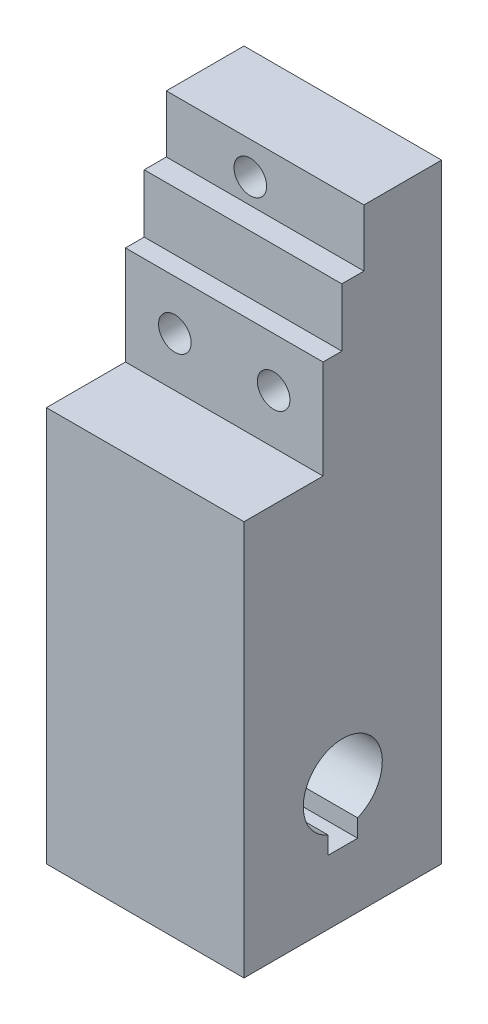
ISO-10303-21;
HEADER;
FILE_DESCRIPTION(('STEP AP214'),'2;1');
FILE_NAME('part.step','',(''),(''),'','','');
FILE_SCHEMA(('AUTOMOTIVE_DESIGN { 1 0 10303 214 1 1 1 1 }'));
ENDSEC;
DATA;
#1=APPLICATION_CONTEXT('core data for automotive mechanical design processes');
#2=APPLICATION_PROTOCOL_DEFINITION('international standard','automotive_design',2000,#1);
#3=PRODUCT_CONTEXT('',#1,'mechanical');
#4=PRODUCT('Part','Part','',(#3));
#5=PRODUCT_RELATED_PRODUCT_CATEGORY('part','',(#4));
#6=PRODUCT_DEFINITION_FORMATION('','',#4);
#7=PRODUCT_DEFINITION_CONTEXT('part definition',#1,'design');
#8=PRODUCT_DEFINITION('design','',#6,#7);
#9=PRODUCT_DEFINITION_SHAPE('','',#8);
#10=(LENGTH_UNIT() NAMED_UNIT(*) SI_UNIT(.MILLI.,.METRE.));
#11=(NAMED_UNIT(*) PLANE_ANGLE_UNIT() SI_UNIT($,.RADIAN.));
#12=(NAMED_UNIT(*) SI_UNIT($,.STERADIAN.) SOLID_ANGLE_UNIT());
#13=UNCERTAINTY_MEASURE_WITH_UNIT(LENGTH_MEASURE(1.E-05),#10,'distance_accuracy_value','');
#14=(GEOMETRIC_REPRESENTATION_CONTEXT(3) GLOBAL_UNCERTAINTY_ASSIGNED_CONTEXT((#13)) GLOBAL_UNIT_ASSIGNED_CONTEXT((#10,
#11,#12)) REPRESENTATION_CONTEXT('',''));
#15=CARTESIAN_POINT('',(0.,0.,0.));
#16=DIRECTION('',(0.,0.,1.));
#17=DIRECTION('',(1.,0.,0.));
#18=AXIS2_PLACEMENT_3D('',#15,#16,#17);
#19=CARTESIAN_POINT('',(0.,0.,20.));
#20=DIRECTION('',(1.,0.,0.));
#21=DIRECTION('',(0.,0.,-1.));
#22=AXIS2_PLACEMENT_3D('',#19,#20,#21);
#23=PLANE('',#22);
#24=DIRECTION('',(0.,-1.,0.));
#25=VECTOR('',#24,1.);
#26=CARTESIAN_POINT('',(0.,6.50000000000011,11.4999999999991));
#27=LINE('',#26,#25);
#28=CARTESIAN_POINT('',(0.,8.29190075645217,11.4999999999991));
#29=VERTEX_POINT('',#28);
#30=CARTESIAN_POINT('',(0.,6.50000000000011,11.4999999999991));
#31=VERTEX_POINT('',#30);
#32=EDGE_CURVE('E143',#29,#31,#27,.T.);
#33=ORIENTED_EDGE('',*,*,#32,.T.);
#34=DIRECTION('',(0.,0.,-1.));
#35=VECTOR('',#34,1.);
#36=CARTESIAN_POINT('',(0.,6.50000000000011,11.4999999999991));
#37=LINE('',#36,#35);
#38=CARTESIAN_POINT('',(0.,6.50000000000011,8.49999999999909));
#39=VERTEX_POINT('',#38);
#40=EDGE_CURVE('E137',#31,#39,#37,.T.);
#41=ORIENTED_EDGE('',*,*,#40,.T.);
#42=DIRECTION('',(0.,1.,0.));
#43=VECTOR('',#42,1.);
#44=CARTESIAN_POINT('',(0.,6.50000000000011,8.49999999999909));
#45=LINE('',#44,#43);
#46=CARTESIAN_POINT('',(0.,8.29190075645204,8.49999999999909));
#47=VERTEX_POINT('',#46);
#48=EDGE_CURVE('E146',#39,#47,#45,.T.);
#49=ORIENTED_EDGE('',*,*,#48,.T.);
#50=CARTESIAN_POINT('',(0.,12.0000000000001,9.99999999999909));
#51=DIRECTION('',(1.,0.,0.));
#52=DIRECTION('',(0.,0.,-1.));
#53=AXIS2_PLACEMENT_3D('',#50,#51,#52);
#54=CIRCLE('',#53,4.00000000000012);
#55=EDGE_CURVE('E49',#47,#29,#54,.T.);
#56=ORIENTED_EDGE('',*,*,#55,.T.);
#57=EDGE_LOOP('',(#33,#41,#49,#56));
#58=FACE_BOUND('',#57,.T.);
#59=DIRECTION('',(0.,-1.,0.));
#60=VECTOR('',#59,1.);
#61=CARTESIAN_POINT('',(0.,55.9000000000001,7.85999999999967));
#62=LINE('',#61,#60);
#63=CARTESIAN_POINT('',(0.,61.7,7.85999999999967));
#64=VERTEX_POINT('',#63);
#65=CARTESIAN_POINT('',(0.,55.9000000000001,7.85999999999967));
#66=VERTEX_POINT('',#65);
#67=EDGE_CURVE('E184',#64,#66,#62,.T.);
#68=ORIENTED_EDGE('',*,*,#67,.F.);
#69=DIRECTION('',(0.,0.,-1.));
#70=VECTOR('',#69,1.);
#71=CARTESIAN_POINT('',(0.,61.6999999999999,20.));
#72=LINE('',#71,#70);
#73=CARTESIAN_POINT('',(0.,61.6999999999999,0.));
#74=VERTEX_POINT('',#73);
#75=EDGE_CURVE('E233',#64,#74,#72,.T.);
#76=ORIENTED_EDGE('',*,*,#75,.T.);
#77=DIRECTION('',(0.,-1.,0.));
#78=VECTOR('',#77,1.);
#79=CARTESIAN_POINT('',(0.,0.,0.));
#80=LINE('',#79,#78);
#81=CARTESIAN_POINT('',(0.,0.,0.));
#82=VERTEX_POINT('',#81);
#83=EDGE_CURVE('E212',#74,#82,#80,.T.);
#84=ORIENTED_EDGE('',*,*,#83,.T.);
#85=DIRECTION('',(0.,0.,-1.));
#86=VECTOR('',#85,1.);
#87=CARTESIAN_POINT('',(0.,0.,20.));
#88=LINE('',#87,#86);
#89=CARTESIAN_POINT('',(0.,0.,20.));
#90=VERTEX_POINT('',#89);
#91=EDGE_CURVE('E12',#90,#82,#88,.T.);
#92=ORIENTED_EDGE('',*,*,#91,.F.);
#93=DIRECTION('',(0.,-1.,0.));
#94=VECTOR('',#93,1.);
#95=CARTESIAN_POINT('',(0.,0.,20.));
#96=LINE('',#95,#94);
#97=CARTESIAN_POINT('',(0.,40.,20.));
#98=VERTEX_POINT('',#97);
#99=EDGE_CURVE('E225',#98,#90,#96,.T.);
#100=ORIENTED_EDGE('',*,*,#99,.F.);
#101=DIRECTION('',(0.,0.,1.));
#102=VECTOR('',#101,1.);
#103=CARTESIAN_POINT('',(0.,40.,20.));
#104=LINE('',#103,#102);
#105=CARTESIAN_POINT('',(0.,40.,12.));
#106=VERTEX_POINT('',#105);
#107=EDGE_CURVE('E182',#106,#98,#104,.T.);
#108=ORIENTED_EDGE('',*,*,#107,.F.);
#109=DIRECTION('',(0.,-1.,0.));
#110=VECTOR('',#109,1.);
#111=CARTESIAN_POINT('',(0.,40.,12.));
#112=LINE('',#111,#110);
#113=CARTESIAN_POINT('',(0.,50.,12.));
#114=VERTEX_POINT('',#113);
#115=EDGE_CURVE('E178',#114,#106,#112,.T.);
#116=ORIENTED_EDGE('',*,*,#115,.F.);
#117=DIRECTION('',(0.,0.,1.));
#118=VECTOR('',#117,1.);
#119=CARTESIAN_POINT('',(0.,50.,12.));
#120=LINE('',#119,#118);
#121=CARTESIAN_POINT('',(0.,50.,10.0999999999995));
#122=VERTEX_POINT('',#121);
#123=EDGE_CURVE('E175',#122,#114,#120,.T.);
#124=ORIENTED_EDGE('',*,*,#123,.F.);
#125=DIRECTION('',(0.,-1.,0.));
#126=VECTOR('',#125,1.);
#127=CARTESIAN_POINT('',(0.,50.,10.0999999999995));
#128=LINE('',#127,#126);
#129=CARTESIAN_POINT('',(0.,55.9000000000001,10.0999999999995));
#130=VERTEX_POINT('',#129);
#131=EDGE_CURVE('E190',#130,#122,#128,.T.);
#132=ORIENTED_EDGE('',*,*,#131,.F.);
#133=DIRECTION('',(0.,0.,1.));
#134=VECTOR('',#133,1.);
#135=CARTESIAN_POINT('',(0.,55.9000000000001,10.0999999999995));
#136=LINE('',#135,#134);
#137=EDGE_CURVE('E187',#66,#130,#136,.T.);
#138=ORIENTED_EDGE('',*,*,#137,.F.);
#139=EDGE_LOOP('',(#68,#76,#84,#92,#100,#108,#116,#124,#132,#138));
#140=FACE_BOUND('',#139,.T.);
#141=ADVANCED_FACE('F33',(#58,#140),#23,.F.);
#142=CARTESIAN_POINT('',(20.,0.,20.));
#143=DIRECTION('',(-1.,0.,0.));
#144=DIRECTION('',(0.,0.,1.));
#145=AXIS2_PLACEMENT_3D('',#142,#143,#144);
#146=PLANE('',#145);
#147=DIRECTION('',(0.,1.,0.));
#148=VECTOR('',#147,1.);
#149=CARTESIAN_POINT('',(20.,6.50000000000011,8.49999999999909));
#150=LINE('',#149,#148);
#151=CARTESIAN_POINT('',(20.,6.50000000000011,8.49999999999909));
#152=VERTEX_POINT('',#151);
#153=CARTESIAN_POINT('',(20.,8.29190075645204,8.49999999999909));
#154=VERTEX_POINT('',#153);
#155=EDGE_CURVE('E164',#152,#154,#150,.T.);
#156=ORIENTED_EDGE('',*,*,#155,.F.);
#157=DIRECTION('',(0.,0.,-1.));
#158=VECTOR('',#157,1.);
#159=CARTESIAN_POINT('',(20.,6.50000000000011,11.4999999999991));
#160=LINE('',#159,#158);
#161=CARTESIAN_POINT('',(20.,6.50000000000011,11.4999999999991));
#162=VERTEX_POINT('',#161);
#163=EDGE_CURVE('E57',#162,#152,#160,.T.);
#164=ORIENTED_EDGE('',*,*,#163,.F.);
#165=DIRECTION('',(0.,-1.,0.));
#166=VECTOR('',#165,1.);
#167=CARTESIAN_POINT('',(20.,6.50000000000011,11.4999999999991));
#168=LINE('',#167,#166);
#169=CARTESIAN_POINT('',(20.,8.29190075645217,11.4999999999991));
#170=VERTEX_POINT('',#169);
#171=EDGE_CURVE('E152',#170,#162,#168,.T.);
#172=ORIENTED_EDGE('',*,*,#171,.F.);
#173=CARTESIAN_POINT('',(20.,12.0000000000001,9.99999999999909));
#174=DIRECTION('',(1.,0.,0.));
#175=DIRECTION('',(0.,0.,-1.));
#176=AXIS2_PLACEMENT_3D('',#173,#174,#175);
#177=CIRCLE('',#176,4.00000000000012);
#178=EDGE_CURVE('E155',#154,#170,#177,.T.);
#179=ORIENTED_EDGE('',*,*,#178,.F.);
#180=EDGE_LOOP('',(#156,#164,#172,#179));
#181=FACE_BOUND('',#180,.T.);
#182=DIRECTION('',(0.,-1.,0.));
#183=VECTOR('',#182,1.);
#184=CARTESIAN_POINT('',(20.,55.9000000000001,7.85999999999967));
#185=LINE('',#184,#183);
#186=CARTESIAN_POINT('',(20.,61.7,7.85999999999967));
#187=VERTEX_POINT('',#186);
#188=CARTESIAN_POINT('',(20.,55.9000000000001,7.85999999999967));
#189=VERTEX_POINT('',#188);
#190=EDGE_CURVE('E202',#187,#189,#185,.T.);
#191=ORIENTED_EDGE('',*,*,#190,.T.);
#192=DIRECTION('',(0.,0.,1.));
#193=VECTOR('',#192,1.);
#194=CARTESIAN_POINT('',(20.,55.9000000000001,10.0999999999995));
#195=LINE('',#194,#193);
#196=CARTESIAN_POINT('',(20.,55.9000000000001,10.0999999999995));
#197=VERTEX_POINT('',#196);
#198=EDGE_CURVE('E205',#189,#197,#195,.T.);
#199=ORIENTED_EDGE('',*,*,#198,.T.);
#200=DIRECTION('',(0.,-1.,0.));
#201=VECTOR('',#200,1.);
#202=CARTESIAN_POINT('',(20.,50.,10.0999999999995));
#203=LINE('',#202,#201);
#204=CARTESIAN_POINT('',(20.,50.,10.0999999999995));
#205=VERTEX_POINT('',#204);
#206=EDGE_CURVE('E179',#197,#205,#203,.T.);
#207=ORIENTED_EDGE('',*,*,#206,.T.);
#208=DIRECTION('',(0.,0.,1.));
#209=VECTOR('',#208,1.);
#210=CARTESIAN_POINT('',(20.,50.,12.));
#211=LINE('',#210,#209);
#212=CARTESIAN_POINT('',(20.,50.,12.));
#213=VERTEX_POINT('',#212);
#214=EDGE_CURVE('E171',#205,#213,#211,.T.);
#215=ORIENTED_EDGE('',*,*,#214,.T.);
#216=DIRECTION('',(0.,-1.,0.));
#217=VECTOR('',#216,1.);
#218=CARTESIAN_POINT('',(20.,40.,12.));
#219=LINE('',#218,#217);
#220=CARTESIAN_POINT('',(20.,40.,12.));
#221=VERTEX_POINT('',#220);
#222=EDGE_CURVE('E196',#213,#221,#219,.T.);
#223=ORIENTED_EDGE('',*,*,#222,.T.);
#224=DIRECTION('',(0.,0.,1.));
#225=VECTOR('',#224,1.);
#226=CARTESIAN_POINT('',(20.,40.,20.));
#227=LINE('',#226,#225);
#228=CARTESIAN_POINT('',(20.,40.,20.));
#229=VERTEX_POINT('',#228);
#230=EDGE_CURVE('E199',#221,#229,#227,.T.);
#231=ORIENTED_EDGE('',*,*,#230,.T.);
#232=DIRECTION('',(0.,1.,0.));
#233=VECTOR('',#232,1.);
#234=CARTESIAN_POINT('',(20.,0.,20.));
#235=LINE('',#234,#233);
#236=CARTESIAN_POINT('',(20.,0.,20.));
#237=VERTEX_POINT('',#236);
#238=EDGE_CURVE('E230',#237,#229,#235,.T.);
#239=ORIENTED_EDGE('',*,*,#238,.F.);
#240=DIRECTION('',(0.,0.,-1.));
#241=VECTOR('',#240,1.);
#242=CARTESIAN_POINT('',(20.,0.,20.));
#243=LINE('',#242,#241);
#244=CARTESIAN_POINT('',(20.,0.,0.));
#245=VERTEX_POINT('',#244);
#246=EDGE_CURVE('E41',#237,#245,#243,.T.);
#247=ORIENTED_EDGE('',*,*,#246,.T.);
#248=DIRECTION('',(0.,1.,0.));
#249=VECTOR('',#248,1.);
#250=CARTESIAN_POINT('',(20.,0.,0.));
#251=LINE('',#250,#249);
#252=CARTESIAN_POINT('',(20.,61.6999999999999,0.));
#253=VERTEX_POINT('',#252);
#254=EDGE_CURVE('E238',#245,#253,#251,.T.);
#255=ORIENTED_EDGE('',*,*,#254,.T.);
#256=DIRECTION('',(0.,0.,-1.));
#257=VECTOR('',#256,1.);
#258=CARTESIAN_POINT('',(20.,61.6999999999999,20.));
#259=LINE('',#258,#257);
#260=EDGE_CURVE('E244',#187,#253,#259,.T.);
#261=ORIENTED_EDGE('',*,*,#260,.F.);
#262=EDGE_LOOP('',(#191,#199,#207,#215,#223,#231,#239,#247,#255,#261));
#263=FACE_BOUND('',#262,.T.);
#264=ADVANCED_FACE('F274',(#181,#263),#146,.F.);
#265=CARTESIAN_POINT('',(0.,61.6999999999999,20.));
#266=DIRECTION('',(0.,-1.,0.));
#267=DIRECTION('',(0.,0.,-1.));
#268=AXIS2_PLACEMENT_3D('',#265,#266,#267);
#269=PLANE('',#268);
#270=DIRECTION('',(1.,0.,0.));
#271=VECTOR('',#270,1.);
#272=CARTESIAN_POINT('',(0.,61.7,7.85999999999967));
#273=LINE('',#272,#271);
#274=EDGE_CURVE('E217',#64,#187,#273,.T.);
#275=ORIENTED_EDGE('',*,*,#274,.T.);
#276=ORIENTED_EDGE('',*,*,#260,.T.);
#277=DIRECTION('',(-1.,0.,0.));
#278=VECTOR('',#277,1.);
#279=CARTESIAN_POINT('',(0.,61.6999999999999,0.));
#280=LINE('',#279,#278);
#281=EDGE_CURVE('E228',#253,#74,#280,.T.);
#282=ORIENTED_EDGE('',*,*,#281,.T.);
#283=ORIENTED_EDGE('',*,*,#75,.F.);
#284=EDGE_LOOP('',(#275,#276,#282,#283));
#285=FACE_BOUND('',#284,.T.);
#286=ADVANCED_FACE('F278',(#285),#269,.F.);
#287=CARTESIAN_POINT('',(0.,61.6999999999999,20.));
#288=DIRECTION('',(0.,0.,-1.));
#289=DIRECTION('',(-1.,0.,0.));
#290=AXIS2_PLACEMENT_3D('',#287,#288,#289);
#291=PLANE('',#290);
#292=DIRECTION('',(1.,0.,0.));
#293=VECTOR('',#292,1.);
#294=CARTESIAN_POINT('',(0.,40.,20.));
#295=LINE('',#294,#293);
#296=EDGE_CURVE('E220',#98,#229,#295,.T.);
#297=ORIENTED_EDGE('',*,*,#296,.F.);
#298=ORIENTED_EDGE('',*,*,#99,.T.);
#299=DIRECTION('',(1.,0.,0.));
#300=VECTOR('',#299,1.);
#301=CARTESIAN_POINT('',(0.,0.,20.));
#302=LINE('',#301,#300);
#303=EDGE_CURVE('E227',#90,#237,#302,.T.);
#304=ORIENTED_EDGE('',*,*,#303,.T.);
#305=ORIENTED_EDGE('',*,*,#238,.T.);
#306=EDGE_LOOP('',(#297,#298,#304,#305));
#307=FACE_BOUND('',#306,.T.);
#308=ADVANCED_FACE('F284',(#307),#291,.F.);
#309=CARTESIAN_POINT('',(0.,0.,20.));
#310=DIRECTION('',(0.,1.,0.));
#311=DIRECTION('',(0.,0.,1.));
#312=AXIS2_PLACEMENT_3D('',#309,#310,#311);
#313=PLANE('',#312);
#314=DIRECTION('',(1.,0.,0.));
#315=VECTOR('',#314,1.);
#316=CARTESIAN_POINT('',(0.,0.,0.));
#317=LINE('',#316,#315);
#318=EDGE_CURVE('E236',#82,#245,#317,.T.);
#319=ORIENTED_EDGE('',*,*,#318,.T.);
#320=ORIENTED_EDGE('',*,*,#246,.F.);
#321=ORIENTED_EDGE('',*,*,#303,.F.);
#322=ORIENTED_EDGE('',*,*,#91,.T.);
#323=EDGE_LOOP('',(#319,#320,#321,#322));
#324=FACE_BOUND('',#323,.T.);
#325=ADVANCED_FACE('F289',(#324),#313,.F.);
#326=CARTESIAN_POINT('',(0.,61.6999999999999,0.));
#327=DIRECTION('',(0.,0.,-1.));
#328=DIRECTION('',(-1.,0.,0.));
#329=AXIS2_PLACEMENT_3D('',#326,#327,#328);
#330=PLANE('',#329);
#331=CARTESIAN_POINT('',(8.5,58.3999999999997,0.));
#332=DIRECTION('',(0.,0.,1.));
#333=DIRECTION('',(1.,0.,0.));
#334=AXIS2_PLACEMENT_3D('',#331,#332,#333);
#335=CIRCLE('',#334,1.65);
#336=CARTESIAN_POINT('',(10.15,58.3999999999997,0.));
#337=VERTEX_POINT('',#336);
#338=EDGE_CURVE('E475',#337,#337,#335,.T.);
#339=ORIENTED_EDGE('',*,*,#338,.T.);
#340=EDGE_LOOP('',(#339));
#341=FACE_BOUND('',#340,.T.);
#342=CARTESIAN_POINT('',(15.,44.9999999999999,0.));
#343=DIRECTION('',(0.,0.,1.));
#344=DIRECTION('',(1.,0.,0.));
#345=AXIS2_PLACEMENT_3D('',#342,#343,#344);
#346=CIRCLE('',#345,1.65);
#347=CARTESIAN_POINT('',(16.65,44.9999999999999,0.));
#348=VERTEX_POINT('',#347);
#349=EDGE_CURVE('E479',#348,#348,#346,.T.);
#350=ORIENTED_EDGE('',*,*,#349,.T.);
#351=EDGE_LOOP('',(#350));
#352=FACE_BOUND('',#351,.T.);
#353=CARTESIAN_POINT('',(5.,44.9999999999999,0.));
#354=DIRECTION('',(0.,0.,1.));
#355=DIRECTION('',(1.,0.,0.));
#356=AXIS2_PLACEMENT_3D('',#353,#354,#355);
#357=CIRCLE('',#356,1.65);
#358=CARTESIAN_POINT('',(6.65,44.9999999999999,0.));
#359=VERTEX_POINT('',#358);
#360=EDGE_CURVE('E485',#359,#359,#357,.T.);
#361=ORIENTED_EDGE('',*,*,#360,.T.);
#362=EDGE_LOOP('',(#361));
#363=FACE_BOUND('',#362,.T.);
#364=CARTESIAN_POINT('',(10.,12.,0.));
#365=DIRECTION('',(0.,0.,-1.));
#366=DIRECTION('',(-1.,0.,0.));
#367=AXIS2_PLACEMENT_3D('',#364,#365,#366);
#368=CIRCLE('',#367,1.64999999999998);
#369=CARTESIAN_POINT('',(8.35000000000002,12.,0.));
#370=VERTEX_POINT('',#369);
#371=EDGE_CURVE('E158',#370,#370,#368,.T.);
#372=ORIENTED_EDGE('',*,*,#371,.F.);
#373=EDGE_LOOP('',(#372));
#374=FACE_BOUND('',#373,.T.);
#375=ORIENTED_EDGE('',*,*,#83,.F.);
#376=ORIENTED_EDGE('',*,*,#281,.F.);
#377=ORIENTED_EDGE('',*,*,#254,.F.);
#378=ORIENTED_EDGE('',*,*,#318,.F.);
#379=EDGE_LOOP('',(#375,#376,#377,#378));
#380=FACE_BOUND('',#379,.T.);
#381=ADVANCED_FACE('F291',(#341,#352,#363,#374,#380),#330,.T.);
#382=CARTESIAN_POINT('',(0.,50.,12.));
#383=DIRECTION('',(0.,1.,0.));
#384=DIRECTION('',(0.,0.,1.));
#385=AXIS2_PLACEMENT_3D('',#382,#383,#384);
#386=PLANE('',#385);
#387=ORIENTED_EDGE('',*,*,#214,.F.);
#388=DIRECTION('',(1.,0.,0.));
#389=VECTOR('',#388,1.);
#390=CARTESIAN_POINT('',(0.,50.,10.0999999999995));
#391=LINE('',#390,#389);
#392=EDGE_CURVE('E210',#122,#205,#391,.T.);
#393=ORIENTED_EDGE('',*,*,#392,.F.);
#394=ORIENTED_EDGE('',*,*,#123,.T.);
#395=DIRECTION('',(1.,0.,0.));
#396=VECTOR('',#395,1.);
#397=CARTESIAN_POINT('',(0.,50.,12.));
#398=LINE('',#397,#396);
#399=EDGE_CURVE('E193',#114,#213,#398,.T.);
#400=ORIENTED_EDGE('',*,*,#399,.T.);
#401=EDGE_LOOP('',(#387,#393,#394,#400));
#402=FACE_BOUND('',#401,.T.);
#403=ADVANCED_FACE('F297',(#402),#386,.T.);
#404=CARTESIAN_POINT('',(0.,50.,10.0999999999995));
#405=DIRECTION('',(0.,0.,1.));
#406=DIRECTION('',(1.,0.,0.));
#407=AXIS2_PLACEMENT_3D('',#404,#405,#406);
#408=PLANE('',#407);
#409=ORIENTED_EDGE('',*,*,#206,.F.);
#410=DIRECTION('',(1.,0.,0.));
#411=VECTOR('',#410,1.);
#412=CARTESIAN_POINT('',(0.,55.9000000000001,10.0999999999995));
#413=LINE('',#412,#411);
#414=EDGE_CURVE('E213',#130,#197,#413,.T.);
#415=ORIENTED_EDGE('',*,*,#414,.F.);
#416=ORIENTED_EDGE('',*,*,#131,.T.);
#417=ORIENTED_EDGE('',*,*,#392,.T.);
#418=EDGE_LOOP('',(#409,#415,#416,#417));
#419=FACE_BOUND('',#418,.T.);
#420=ADVANCED_FACE('F321',(#419),#408,.T.);
#421=CARTESIAN_POINT('',(0.,55.9000000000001,10.0999999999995));
#422=DIRECTION('',(0.,1.,0.));
#423=DIRECTION('',(0.,0.,1.));
#424=AXIS2_PLACEMENT_3D('',#421,#422,#423);
#425=PLANE('',#424);
#426=ORIENTED_EDGE('',*,*,#198,.F.);
#427=DIRECTION('',(1.,0.,0.));
#428=VECTOR('',#427,1.);
#429=CARTESIAN_POINT('',(0.,55.9000000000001,7.85999999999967));
#430=LINE('',#429,#428);
#431=EDGE_CURVE('E215',#66,#189,#430,.T.);
#432=ORIENTED_EDGE('',*,*,#431,.F.);
#433=ORIENTED_EDGE('',*,*,#137,.T.);
#434=ORIENTED_EDGE('',*,*,#414,.T.);
#435=EDGE_LOOP('',(#426,#432,#433,#434));
#436=FACE_BOUND('',#435,.T.);
#437=ADVANCED_FACE('F317',(#436),#425,.T.);
#438=CARTESIAN_POINT('',(0.,55.9000000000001,7.85999999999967));
#439=DIRECTION('',(0.,0.,1.));
#440=DIRECTION('',(1.,0.,0.));
#441=AXIS2_PLACEMENT_3D('',#438,#439,#440);
#442=PLANE('',#441);
#443=CARTESIAN_POINT('',(8.5,58.3999999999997,7.85999999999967));
#444=DIRECTION('',(0.,0.,1.));
#445=DIRECTION('',(1.,0.,0.));
#446=AXIS2_PLACEMENT_3D('',#443,#444,#445);
#447=CIRCLE('',#446,1.65);
#448=CARTESIAN_POINT('',(10.15,58.3999999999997,7.85999999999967));
#449=VERTEX_POINT('',#448);
#450=EDGE_CURVE('E36',#449,#449,#447,.T.);
#451=ORIENTED_EDGE('',*,*,#450,.F.);
#452=EDGE_LOOP('',(#451));
#453=FACE_BOUND('',#452,.T.);
#454=ORIENTED_EDGE('',*,*,#190,.F.);
#455=ORIENTED_EDGE('',*,*,#274,.F.);
#456=ORIENTED_EDGE('',*,*,#67,.T.);
#457=ORIENTED_EDGE('',*,*,#431,.T.);
#458=EDGE_LOOP('',(#454,#455,#456,#457));
#459=FACE_BOUND('',#458,.T.);
#460=ADVANCED_FACE('F313',(#453,#459),#442,.T.);
#461=CARTESIAN_POINT('',(0.,40.,20.));
#462=DIRECTION('',(0.,1.,0.));
#463=DIRECTION('',(0.,0.,1.));
#464=AXIS2_PLACEMENT_3D('',#461,#462,#463);
#465=PLANE('',#464);
#466=ORIENTED_EDGE('',*,*,#230,.F.);
#467=DIRECTION('',(1.,0.,0.));
#468=VECTOR('',#467,1.);
#469=CARTESIAN_POINT('',(0.,40.,12.));
#470=LINE('',#469,#468);
#471=EDGE_CURVE('E222',#106,#221,#470,.T.);
#472=ORIENTED_EDGE('',*,*,#471,.F.);
#473=ORIENTED_EDGE('',*,*,#107,.T.);
#474=ORIENTED_EDGE('',*,*,#296,.T.);
#475=EDGE_LOOP('',(#466,#472,#473,#474));
#476=FACE_BOUND('',#475,.T.);
#477=ADVANCED_FACE('F331',(#476),#465,.T.);
#478=CARTESIAN_POINT('',(0.,40.,12.));
#479=DIRECTION('',(0.,0.,1.));
#480=DIRECTION('',(1.,0.,0.));
#481=AXIS2_PLACEMENT_3D('',#478,#479,#480);
#482=PLANE('',#481);
#483=CARTESIAN_POINT('',(15.,44.9999999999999,12.));
#484=DIRECTION('',(0.,0.,1.));
#485=DIRECTION('',(1.,0.,0.));
#486=AXIS2_PLACEMENT_3D('',#483,#484,#485);
#487=CIRCLE('',#486,1.65);
#488=CARTESIAN_POINT('',(16.65,44.9999999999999,12.));
#489=VERTEX_POINT('',#488);
#490=EDGE_CURVE('E477',#489,#489,#487,.T.);
#491=ORIENTED_EDGE('',*,*,#490,.F.);
#492=EDGE_LOOP('',(#491));
#493=FACE_BOUND('',#492,.T.);
#494=CARTESIAN_POINT('',(5.,44.9999999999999,12.));
#495=DIRECTION('',(0.,0.,1.));
#496=DIRECTION('',(1.,0.,0.));
#497=AXIS2_PLACEMENT_3D('',#494,#495,#496);
#498=CIRCLE('',#497,1.65);
#499=CARTESIAN_POINT('',(6.65,44.9999999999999,12.));
#500=VERTEX_POINT('',#499);
#501=EDGE_CURVE('E482',#500,#500,#498,.T.);
#502=ORIENTED_EDGE('',*,*,#501,.F.);
#503=EDGE_LOOP('',(#502));
#504=FACE_BOUND('',#503,.T.);
#505=ORIENTED_EDGE('',*,*,#222,.F.);
#506=ORIENTED_EDGE('',*,*,#399,.F.);
#507=ORIENTED_EDGE('',*,*,#115,.T.);
#508=ORIENTED_EDGE('',*,*,#471,.T.);
#509=EDGE_LOOP('',(#505,#506,#507,#508));
#510=FACE_BOUND('',#509,.T.);
#511=ADVANCED_FACE('F271',(#493,#504,#510),#482,.T.);
#512=CARTESIAN_POINT('',(0.,6.50000000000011,11.4999999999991));
#513=DIRECTION('',(0.,-1.,0.));
#514=DIRECTION('',(0.,0.,-1.));
#515=AXIS2_PLACEMENT_3D('',#512,#513,#514);
#516=PLANE('',#515);
#517=ORIENTED_EDGE('',*,*,#163,.T.);
#518=DIRECTION('',(1.,0.,0.));
#519=VECTOR('',#518,1.);
#520=CARTESIAN_POINT('',(0.,6.50000000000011,8.49999999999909));
#521=LINE('',#520,#519);
#522=EDGE_CURVE('E133',#39,#152,#521,.T.);
#523=ORIENTED_EDGE('',*,*,#522,.F.);
#524=ORIENTED_EDGE('',*,*,#40,.F.);
#525=DIRECTION('',(1.,0.,0.));
#526=VECTOR('',#525,1.);
#527=CARTESIAN_POINT('',(0.,6.50000000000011,11.4999999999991));
#528=LINE('',#527,#526);
#529=EDGE_CURVE('E169',#31,#162,#528,.T.);
#530=ORIENTED_EDGE('',*,*,#529,.T.);
#531=EDGE_LOOP('',(#517,#523,#524,#530));
#532=FACE_BOUND('',#531,.T.);
#533=ADVANCED_FACE('F135',(#532),#516,.F.);
#534=CARTESIAN_POINT('',(0.,6.50000000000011,11.4999999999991));
#535=DIRECTION('',(0.,0.,1.));
#536=DIRECTION('',(1.,0.,0.));
#537=AXIS2_PLACEMENT_3D('',#534,#535,#536);
#538=PLANE('',#537);
#539=ORIENTED_EDGE('',*,*,#171,.T.);
#540=ORIENTED_EDGE('',*,*,#529,.F.);
#541=ORIENTED_EDGE('',*,*,#32,.F.);
#542=DIRECTION('',(1.,0.,0.));
#543=VECTOR('',#542,1.);
#544=CARTESIAN_POINT('',(0.,8.29190075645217,11.4999999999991));
#545=LINE('',#544,#543);
#546=EDGE_CURVE('E172',#29,#170,#545,.T.);
#547=ORIENTED_EDGE('',*,*,#546,.T.);
#548=EDGE_LOOP('',(#539,#540,#541,#547));
#549=FACE_BOUND('',#548,.T.);
#550=ADVANCED_FACE('F263',(#549),#538,.F.);
#551=CARTESIAN_POINT('',(0.,12.0000000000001,9.99999999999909));
#552=DIRECTION('',(1.,0.,0.));
#553=DIRECTION('',(0.,0.,-1.));
#554=AXIS2_PLACEMENT_3D('',#551,#552,#553);
#555=CYLINDRICAL_SURFACE('',#554,4.00000000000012);
#556=CARTESIAN_POINT('',(8.35000000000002,12.,5.99999999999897));
#557=CARTESIAN_POINT('',(8.35000921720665,12.0884596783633,6.00000690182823));
#558=CARTESIAN_POINT('',(8.35715601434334,12.1770622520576,6.00296854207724));
#559=CARTESIAN_POINT('',(8.38549114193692,12.3517596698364,6.01452886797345));
#560=CARTESIAN_POINT('',(8.40671651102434,12.437847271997,6.02314242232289));
#561=CARTESIAN_POINT('',(8.46229481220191,12.6047024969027,6.04508034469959));
#562=CARTESIAN_POINT('',(8.49660364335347,12.6854869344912,6.05838887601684));
#563=CARTESIAN_POINT('',(8.57719475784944,12.8400766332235,6.08841713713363));
#564=CARTESIAN_POINT('',(8.62347328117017,12.9138840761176,6.10513579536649));
#565=CARTESIAN_POINT('',(8.72910675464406,13.0561876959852,6.14123099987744));
#566=CARTESIAN_POINT('',(8.78895767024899,13.1242937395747,6.16069345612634));
#567=CARTESIAN_POINT('',(8.91898883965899,13.2498357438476,6.19970516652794));
#568=CARTESIAN_POINT('',(8.98917439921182,13.3072661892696,6.2192544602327));
#569=CARTESIAN_POINT('',(9.14196824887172,13.4125482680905,6.25727448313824));
#570=CARTESIAN_POINT('',(9.22501111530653,13.4598078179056,6.27564840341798));
#571=CARTESIAN_POINT('',(9.39873630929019,13.539513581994,6.30787863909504));
#572=CARTESIAN_POINT('',(9.48941475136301,13.5719672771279,6.32173723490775));
#573=CARTESIAN_POINT('',(9.67134799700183,13.6195373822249,6.34243978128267));
#574=CARTESIAN_POINT('',(9.76237107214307,13.6354037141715,6.34958550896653));
#575=CARTESIAN_POINT('',(9.94604650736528,13.651689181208,6.35692285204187));
#576=CARTESIAN_POINT('',(10.0386979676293,13.65211659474,6.35711819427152));
#577=CARTESIAN_POINT('',(10.2155988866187,13.6380778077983,6.35078861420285));
#578=CARTESIAN_POINT('',(10.2999581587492,13.6247239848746,6.3447656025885));
#579=CARTESIAN_POINT('',(10.4651102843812,13.585364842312,6.32752467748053));
#580=CARTESIAN_POINT('',(10.5459024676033,13.5593571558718,6.31630579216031));
#581=CARTESIAN_POINT('',(10.7036451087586,13.4949241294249,6.2896854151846));
#582=CARTESIAN_POINT('',(10.7804787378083,13.4562486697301,6.27420076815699));
#583=CARTESIAN_POINT('',(10.92686023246,13.3677544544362,6.24081383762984));
#584=CARTESIAN_POINT('',(10.9964052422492,13.3179313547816,6.22291061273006));
#585=CARTESIAN_POINT('',(11.1322864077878,13.2037191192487,6.18490257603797));
#586=CARTESIAN_POINT('',(11.1978819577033,13.1384663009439,6.16473811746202));
#587=CARTESIAN_POINT('',(11.3174446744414,12.9976825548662,6.1257308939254));
#588=CARTESIAN_POINT('',(11.3714092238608,12.9221493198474,6.10688842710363));
#589=CARTESIAN_POINT('',(11.467234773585,12.7607363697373,6.07212067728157));
#590=CARTESIAN_POINT('',(11.5088002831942,12.6746640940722,6.05626949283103));
#591=CARTESIAN_POINT('',(11.5766030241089,12.495928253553,6.0298368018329));
#592=CARTESIAN_POINT('',(11.6028485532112,12.4032682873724,6.01925244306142));
#593=CARTESIAN_POINT('',(11.6377295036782,12.2201813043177,6.00507549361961));
#594=CARTESIAN_POINT('',(11.6473591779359,12.1299741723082,6.00108878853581));
#595=CARTESIAN_POINT('',(11.6516920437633,11.9491525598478,5.99930253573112));
#596=CARTESIAN_POINT('',(11.6463994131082,11.8585382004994,6.00150125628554));
#597=CARTESIAN_POINT('',(11.621754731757,11.6840922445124,6.01158252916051));
#598=CARTESIAN_POINT('',(11.6030959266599,11.6001446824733,6.01918468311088));
#599=CARTESIAN_POINT('',(11.5532079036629,11.4366595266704,6.03901112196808));
#600=CARTESIAN_POINT('',(11.5219770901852,11.3571224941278,6.05123599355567));
#601=CARTESIAN_POINT('',(11.4468106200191,11.2019380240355,6.07960271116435));
#602=CARTESIAN_POINT('',(11.4025114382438,11.1264873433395,6.09585414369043));
#603=CARTESIAN_POINT('',(11.3028660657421,10.9838215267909,6.13053231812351));
#604=CARTESIAN_POINT('',(11.2475153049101,10.9166098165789,6.14895995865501));
#605=CARTESIAN_POINT('',(11.122795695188,10.7873800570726,6.1875970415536));
#606=CARTESIAN_POINT('',(11.0527161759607,10.7260563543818,6.20784083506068));
#607=CARTESIAN_POINT('',(10.9029287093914,10.615851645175,6.2466607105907));
#608=CARTESIAN_POINT('',(10.8232187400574,10.5669732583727,6.26523644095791));
#609=CARTESIAN_POINT('',(10.6549046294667,10.4825771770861,6.29871299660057));
#610=CARTESIAN_POINT('',(10.5661980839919,10.4472419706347,6.31356275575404));
#611=CARTESIAN_POINT('',(10.3832908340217,10.3923038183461,6.33718359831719));
#612=CARTESIAN_POINT('',(10.2890946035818,10.3726882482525,6.34595955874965));
#613=CARTESIAN_POINT('',(10.1055697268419,10.3509887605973,6.35570440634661));
#614=CARTESIAN_POINT('',(10.016412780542,10.3476895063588,6.35721426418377));
#615=CARTESIAN_POINT('',(9.8388715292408,10.3554851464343,6.35368821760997));
#616=CARTESIAN_POINT('',(9.75048711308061,10.3665779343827,6.34865327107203));
#617=CARTESIAN_POINT('',(9.58106692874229,10.4018288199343,6.333095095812));
#618=CARTESIAN_POINT('',(9.49987928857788,10.4253804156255,6.32282738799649));
#619=CARTESIAN_POINT('',(9.34258547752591,10.4842940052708,6.29815588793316));
#620=CARTESIAN_POINT('',(9.26648073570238,10.5196593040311,6.28375093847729));
#621=CARTESIAN_POINT('',(9.1165779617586,10.6036193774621,6.25136591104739));
#622=CARTESIAN_POINT('',(9.04318592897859,10.6528755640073,6.23322422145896));
#623=CARTESIAN_POINT('',(8.90532831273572,10.7622828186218,6.1958713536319));
#624=CARTESIAN_POINT('',(8.84086573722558,10.8224375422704,6.17665981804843));
#625=CARTESIAN_POINT('',(8.71800586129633,10.9569926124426,6.13769827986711));
#626=CARTESIAN_POINT('',(8.66036077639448,11.0320998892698,6.11800640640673));
#627=CARTESIAN_POINT('',(8.55845984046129,11.191656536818,6.08167573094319));
#628=CARTESIAN_POINT('',(8.51421011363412,11.2761101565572,6.06503832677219));
#629=CARTESIAN_POINT('',(8.44133626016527,11.4505852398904,6.03694308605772));
#630=CARTESIAN_POINT('',(8.41245757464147,11.5404866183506,6.02540144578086));
#631=CARTESIAN_POINT('',(8.37048891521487,11.7242807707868,6.00845561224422));
#632=CARTESIAN_POINT('',(8.35734933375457,11.818160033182,6.00303213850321));
#633=CARTESIAN_POINT('',(8.35077322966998,11.9415557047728,6.00031805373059));
#634=CARTESIAN_POINT('',(8.34999695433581,11.9707700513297,5.99999771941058));
#635=CARTESIAN_POINT('',(8.35000000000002,12.,5.99999999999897));
#636=B_SPLINE_CURVE_WITH_KNOTS('',3,(#556,#557,#558,#559,#560,#561,#562,#563,#564,#565,#566,
#567,#568,#569,#570,#571,#572,#573,#574,#575,#576,#577,#578,#579,#580,#581,#582,#583,#584,#585,
#586,#587,#588,#589,#590,#591,#592,#593,#594,#595,#596,#597,#598,#599,#600,#601,#602,#603,#604,
#605,#606,#607,#608,#609,#610,#611,#612,#613,#614,#615,#616,#617,#618,#619,#620,#621,#622,#623,
#624,#625,#626,#627,#628,#629,#630,#631,#632,#633,#634,#635),.UNSPECIFIED.,.T.,.F.,(4,2,2,2,2,2,
2,2,2,2,2,2,2,2,2,2,2,2,2,2,2,2,2,2,2,2,2,2,2,2,2,2,2,2,2,2,2,2,2,4),(0.,0.265297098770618,
0.531294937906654,0.796403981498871,1.06142984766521,1.33841878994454,1.61555043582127,
1.90598404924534,2.19627075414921,2.47277648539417,2.74913395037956,3.00480633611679,
3.26052656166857,3.52163539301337,3.78284615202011,4.06565185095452,4.34852112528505,
4.63767392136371,4.92666995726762,5.19768149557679,5.46861716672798,5.72643264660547,
5.98428085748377,6.25011488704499,6.51605907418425,6.80064580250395,7.08529238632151,
7.37364985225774,7.66177550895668,7.92807823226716,8.19434198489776,8.44869772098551,
8.70312467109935,8.972674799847,9.24231550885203,9.53104085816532,9.81989801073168,
10.1038095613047,10.3868238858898,10.4744866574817),.UNSPECIFIED.);
#637=CARTESIAN_POINT('',(8.35000000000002,12.,5.99999999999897));
#638=VERTEX_POINT('',#637);
#639=EDGE_CURVE('E165',#638,#638,#636,.T.);
#640=ORIENTED_EDGE('',*,*,#639,.T.);
#641=EDGE_LOOP('',(#640));
#642=FACE_BOUND('',#641,.T.);
#643=ORIENTED_EDGE('',*,*,#178,.T.);
#644=ORIENTED_EDGE('',*,*,#546,.F.);
#645=ORIENTED_EDGE('',*,*,#55,.F.);
#646=DIRECTION('',(1.,0.,0.));
#647=VECTOR('',#646,1.);
#648=CARTESIAN_POINT('',(0.,8.29190075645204,8.49999999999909));
#649=LINE('',#648,#647);
#650=EDGE_CURVE('E142',#47,#154,#649,.T.);
#651=ORIENTED_EDGE('',*,*,#650,.T.);
#652=EDGE_LOOP('',(#643,#644,#645,#651));
#653=FACE_BOUND('',#652,.T.);
#654=ADVANCED_FACE('F252',(#642,#653),#555,.F.);
#655=CARTESIAN_POINT('',(0.,6.50000000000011,8.49999999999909));
#656=DIRECTION('',(0.,0.,-1.));
#657=DIRECTION('',(-1.,0.,0.));
#658=AXIS2_PLACEMENT_3D('',#655,#656,#657);
#659=PLANE('',#658);
#660=ORIENTED_EDGE('',*,*,#155,.T.);
#661=ORIENTED_EDGE('',*,*,#650,.F.);
#662=ORIENTED_EDGE('',*,*,#48,.F.);
#663=ORIENTED_EDGE('',*,*,#522,.T.);
#664=EDGE_LOOP('',(#660,#661,#662,#663));
#665=FACE_BOUND('',#664,.T.);
#666=ADVANCED_FACE('F147',(#665),#659,.F.);
#667=CARTESIAN_POINT('',(10.,12.,8.));
#668=DIRECTION('',(0.,0.,-1.));
#669=DIRECTION('',(-1.,0.,0.));
#670=AXIS2_PLACEMENT_3D('',#667,#668,#669);
#671=CYLINDRICAL_SURFACE('',#670,1.64999999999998);
#672=ORIENTED_EDGE('',*,*,#371,.T.);
#673=EDGE_LOOP('',(#672));
#674=FACE_BOUND('',#673,.T.);
#675=ORIENTED_EDGE('',*,*,#639,.F.);
#676=EDGE_LOOP('',(#675));
#677=FACE_BOUND('',#676,.T.);
#678=ADVANCED_FACE('F256',(#674,#677),#671,.F.);
#679=CARTESIAN_POINT('',(5.,44.9999999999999,0.));
#680=DIRECTION('',(0.,0.,1.));
#681=DIRECTION('',(1.,0.,0.));
#682=AXIS2_PLACEMENT_3D('',#679,#680,#681);
#683=CYLINDRICAL_SURFACE('',#682,1.65);
#684=ORIENTED_EDGE('',*,*,#360,.F.);
#685=EDGE_LOOP('',(#684));
#686=FACE_BOUND('',#685,.T.);
#687=ORIENTED_EDGE('',*,*,#501,.T.);
#688=EDGE_LOOP('',(#687));
#689=FACE_BOUND('',#688,.T.);
#690=ADVANCED_FACE('F260',(#686,#689),#683,.F.);
#691=CARTESIAN_POINT('',(15.,44.9999999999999,0.));
#692=DIRECTION('',(0.,0.,1.));
#693=DIRECTION('',(1.,0.,0.));
#694=AXIS2_PLACEMENT_3D('',#691,#692,#693);
#695=CYLINDRICAL_SURFACE('',#694,1.65);
#696=ORIENTED_EDGE('',*,*,#349,.F.);
#697=EDGE_LOOP('',(#696));
#698=FACE_BOUND('',#697,.T.);
#699=ORIENTED_EDGE('',*,*,#490,.T.);
#700=EDGE_LOOP('',(#699));
#701=FACE_BOUND('',#700,.T.);
#702=ADVANCED_FACE('F370',(#698,#701),#695,.F.);
#703=CARTESIAN_POINT('',(8.5,58.3999999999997,0.));
#704=DIRECTION('',(0.,0.,1.));
#705=DIRECTION('',(1.,0.,0.));
#706=AXIS2_PLACEMENT_3D('',#703,#704,#705);
#707=CYLINDRICAL_SURFACE('',#706,1.65);
#708=ORIENTED_EDGE('',*,*,#450,.T.);
#709=EDGE_LOOP('',(#708));
#710=FACE_BOUND('',#709,.T.);
#711=ORIENTED_EDGE('',*,*,#338,.F.);
#712=EDGE_LOOP('',(#711));
#713=FACE_BOUND('',#712,.T.);
#714=ADVANCED_FACE('F378',(#710,#713),#707,.F.);
#715=CLOSED_SHELL('',(#141,#264,#286,#308,#325,#381,#403,#420,#437,#460,#477,#511,#533,#550,
#654,#666,#678,#690,#702,#714));
#716=MANIFOLD_SOLID_BREP('B2',#715);
#717=ADVANCED_BREP_SHAPE_REPRESENTATION('',(#18,#716),#14);
#718=SHAPE_DEFINITION_REPRESENTATION(#9,#717);
ENDSEC;
END-ISO-10303-21;
